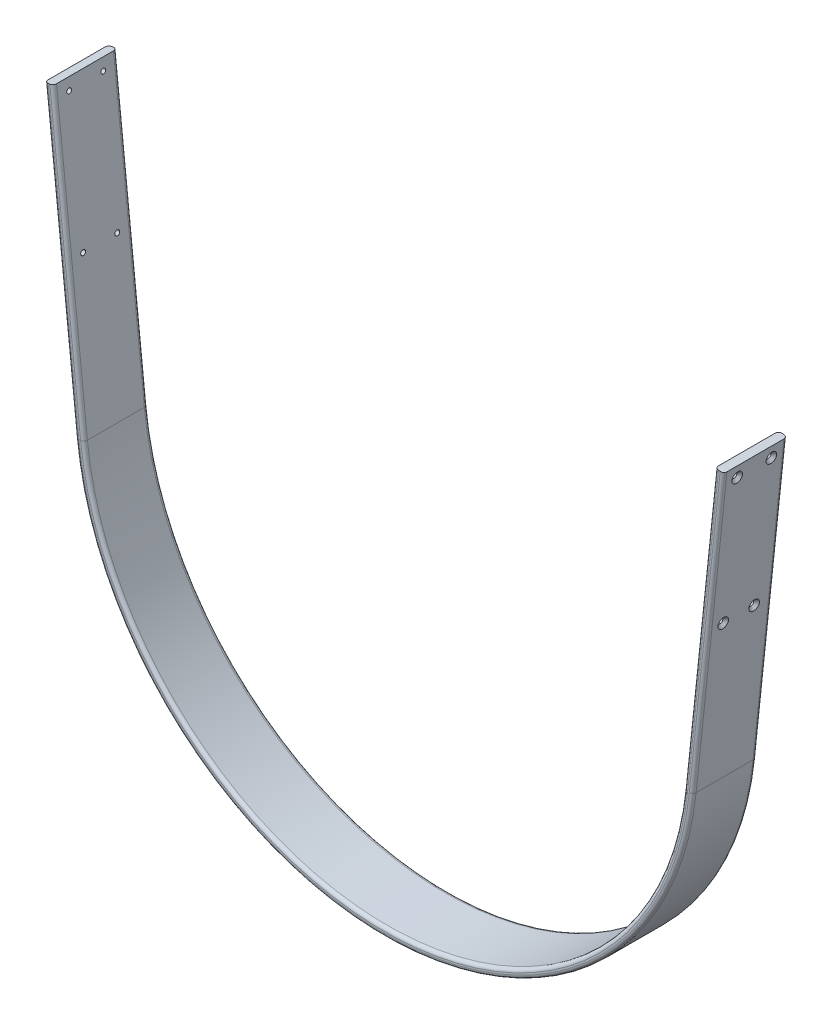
ISO-10303-21;
HEADER;
FILE_DESCRIPTION(('STEP AP214'),'2;1');
FILE_NAME('part.step','',(''),(''),'','','');
FILE_SCHEMA(('AUTOMOTIVE_DESIGN { 1 0 10303 214 1 1 1 1 }'));
ENDSEC;
DATA;
#1=APPLICATION_CONTEXT('core data for automotive mechanical design processes');
#2=APPLICATION_PROTOCOL_DEFINITION('international standard','automotive_design',2000,#1);
#3=PRODUCT_CONTEXT('',#1,'mechanical');
#4=PRODUCT('Part','Part','',(#3));
#5=PRODUCT_RELATED_PRODUCT_CATEGORY('part','',(#4));
#6=PRODUCT_DEFINITION_FORMATION('','',#4);
#7=PRODUCT_DEFINITION_CONTEXT('part definition',#1,'design');
#8=PRODUCT_DEFINITION('design','',#6,#7);
#9=PRODUCT_DEFINITION_SHAPE('','',#8);
#10=(LENGTH_UNIT() NAMED_UNIT(*) SI_UNIT(.MILLI.,.METRE.));
#11=(NAMED_UNIT(*) PLANE_ANGLE_UNIT() SI_UNIT($,.RADIAN.));
#12=(NAMED_UNIT(*) SI_UNIT($,.STERADIAN.) SOLID_ANGLE_UNIT());
#13=UNCERTAINTY_MEASURE_WITH_UNIT(LENGTH_MEASURE(1.E-05),#10,'distance_accuracy_value','');
#14=(GEOMETRIC_REPRESENTATION_CONTEXT(3) GLOBAL_UNCERTAINTY_ASSIGNED_CONTEXT((#13)) GLOBAL_UNIT_ASSIGNED_CONTEXT((#10,
#11,#12)) REPRESENTATION_CONTEXT('',''));
#15=CARTESIAN_POINT('',(0.,0.,0.));
#16=DIRECTION('',(0.,0.,1.));
#17=DIRECTION('',(1.,0.,0.));
#18=AXIS2_PLACEMENT_3D('',#15,#16,#17);
#19=CARTESIAN_POINT('',(0.,0.,56.));
#20=DIRECTION('',(0.,0.,-1.));
#21=DIRECTION('',(-1.,0.,0.));
#22=AXIS2_PLACEMENT_3D('',#19,#20,#21);
#23=CYLINDRICAL_SURFACE('',#22,545.);
#24=DIRECTION('',(0.,0.,-1.));
#25=VECTOR('',#24,1.);
#26=CARTESIAN_POINT('',(-542.014432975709,-56.9680124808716,56.));
#27=LINE('',#26,#25);
#28=CARTESIAN_POINT('',(-542.014432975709,-56.9680124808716,50.));
#29=VERTEX_POINT('',#28);
#30=CARTESIAN_POINT('',(-542.014432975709,-56.9680124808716,-50.));
#31=VERTEX_POINT('',#30);
#32=EDGE_CURVE('E207',#29,#31,#27,.T.);
#33=ORIENTED_EDGE('',*,*,#32,.T.);
#34=CARTESIAN_POINT('',(0.,0.,-50.));
#35=DIRECTION('',(0.,0.,1.));
#36=DIRECTION('',(1.,0.,0.));
#37=AXIS2_PLACEMENT_3D('',#34,#35,#36);
#38=CIRCLE('',#37,545.);
#39=CARTESIAN_POINT('',(542.014432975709,-56.9680124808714,-50.));
#40=VERTEX_POINT('',#39);
#41=EDGE_CURVE('E271',#31,#40,#38,.T.);
#42=ORIENTED_EDGE('',*,*,#41,.T.);
#43=DIRECTION('',(0.,0.,-1.));
#44=VECTOR('',#43,1.);
#45=CARTESIAN_POINT('',(542.014432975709,-56.9680124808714,56.));
#46=LINE('',#45,#44);
#47=CARTESIAN_POINT('',(542.014432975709,-56.9680124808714,50.));
#48=VERTEX_POINT('',#47);
#49=EDGE_CURVE('E176',#48,#40,#46,.T.);
#50=ORIENTED_EDGE('',*,*,#49,.F.);
#51=CARTESIAN_POINT('',(0.,0.,50.));
#52=DIRECTION('',(0.,0.,1.));
#53=DIRECTION('',(1.,0.,0.));
#54=AXIS2_PLACEMENT_3D('',#51,#52,#53);
#55=CIRCLE('',#54,545.);
#56=EDGE_CURVE('E51',#48,#29,#55,.F.);
#57=ORIENTED_EDGE('',*,*,#56,.T.);
#58=EDGE_LOOP('',(#33,#42,#50,#57));
#59=FACE_BOUND('',#58,.T.);
#60=ADVANCED_FACE('F30',(#59),#23,.T.);
#61=CARTESIAN_POINT('',(542.014432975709,-56.9680124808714,56.));
#62=DIRECTION('',(-0.994521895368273,0.104528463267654,0.));
#63=DIRECTION('',(-0.104528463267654,-0.994521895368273,0.));
#64=AXIS2_PLACEMENT_3D('',#61,#62,#63);
#65=PLANE('',#64);
#66=CARTESIAN_POINT('',(594.069607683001,438.303891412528,-30.));
#67=DIRECTION('',(-0.994521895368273,0.104528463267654,0.));
#68=DIRECTION('',(-0.104528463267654,-0.994521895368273,0.));
#69=AXIS2_PLACEMENT_3D('',#66,#67,#68);
#70=CIRCLE('',#69,9.24999999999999);
#71=CARTESIAN_POINT('',(593.102719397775,429.104563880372,-30.));
#72=VERTEX_POINT('',#71);
#73=EDGE_CURVE('E319',#72,#72,#70,.T.);
#74=ORIENTED_EDGE('',*,*,#73,.T.);
#75=EDGE_LOOP('',(#74));
#76=FACE_BOUND('',#75,.T.);
#77=CARTESIAN_POINT('',(594.069607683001,438.303891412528,30.));
#78=DIRECTION('',(-0.994521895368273,0.104528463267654,0.));
#79=DIRECTION('',(-0.104528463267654,-0.994521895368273,0.));
#80=AXIS2_PLACEMENT_3D('',#77,#78,#79);
#81=CIRCLE('',#80,9.24999999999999);
#82=CARTESIAN_POINT('',(593.102719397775,429.104563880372,30.));
#83=VERTEX_POINT('',#82);
#84=EDGE_CURVE('E316',#83,#83,#81,.T.);
#85=ORIENTED_EDGE('',*,*,#84,.T.);
#86=EDGE_LOOP('',(#85));
#87=FACE_BOUND('',#86,.T.);
#88=CARTESIAN_POINT('',(569.505418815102,204.591246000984,30.));
#89=DIRECTION('',(-0.994521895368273,0.104528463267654,0.));
#90=DIRECTION('',(-0.104528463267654,-0.994521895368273,0.));
#91=AXIS2_PLACEMENT_3D('',#88,#89,#90);
#92=CIRCLE('',#91,9.25);
#93=CARTESIAN_POINT('',(568.538530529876,195.391918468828,30.));
#94=VERTEX_POINT('',#93);
#95=EDGE_CURVE('E313',#94,#94,#92,.T.);
#96=ORIENTED_EDGE('',*,*,#95,.T.);
#97=EDGE_LOOP('',(#96));
#98=FACE_BOUND('',#97,.T.);
#99=CARTESIAN_POINT('',(569.505418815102,204.591246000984,-24.4242126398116));
#100=DIRECTION('',(-0.994521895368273,0.104528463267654,0.));
#101=DIRECTION('',(-0.104528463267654,-0.994521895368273,0.));
#102=AXIS2_PLACEMENT_3D('',#99,#100,#101);
#103=CIRCLE('',#102,9.25);
#104=CARTESIAN_POINT('',(568.538530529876,195.391918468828,-24.4242126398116));
#105=VERTEX_POINT('',#104);
#106=EDGE_CURVE('E310',#105,#105,#103,.T.);
#107=ORIENTED_EDGE('',*,*,#106,.T.);
#108=EDGE_LOOP('',(#107));
#109=FACE_BOUND('',#108,.T.);
#110=ORIENTED_EDGE('',*,*,#49,.T.);
#111=DIRECTION('',(0.104528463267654,0.994521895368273,0.));
#112=VECTOR('',#111,1.);
#113=CARTESIAN_POINT('',(542.014432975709,-56.9680124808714,-50.));
#114=LINE('',#113,#112);
#115=CARTESIAN_POINT('',(596.160176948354,458.194329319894,-50.));
#116=VERTEX_POINT('',#115);
#117=EDGE_CURVE('E267',#40,#116,#114,.T.);
#118=ORIENTED_EDGE('',*,*,#117,.T.);
#119=DIRECTION('',(0.,0.,-1.));
#120=VECTOR('',#119,1.);
#121=CARTESIAN_POINT('',(596.160176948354,458.194329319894,56.));
#122=LINE('',#121,#120);
#123=CARTESIAN_POINT('',(596.160176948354,458.194329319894,50.));
#124=VERTEX_POINT('',#123);
#125=EDGE_CURVE('E216',#124,#116,#122,.T.);
#126=ORIENTED_EDGE('',*,*,#125,.F.);
#127=DIRECTION('',(0.104528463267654,0.994521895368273,0.));
#128=VECTOR('',#127,1.);
#129=CARTESIAN_POINT('',(542.014432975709,-56.9680124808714,50.));
#130=LINE('',#129,#128);
#131=EDGE_CURVE('E265',#124,#48,#130,.F.);
#132=ORIENTED_EDGE('',*,*,#131,.T.);
#133=EDGE_LOOP('',(#110,#118,#126,#132));
#134=FACE_BOUND('',#133,.T.);
#135=ADVANCED_FACE('F347',(#76,#87,#98,#109,#134),#65,.F.);
#136=CARTESIAN_POINT('',(596.160176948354,458.194329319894,56.));
#137=DIRECTION('',(-0.104528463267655,-0.994521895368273,0.));
#138=DIRECTION('',(0.994521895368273,-0.104528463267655,0.));
#139=AXIS2_PLACEMENT_3D('',#136,#137,#138);
#140=PLANE('',#139);
#141=DIRECTION('',(-0.994521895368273,0.104528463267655,0.));
#142=VECTOR('',#141,1.);
#143=CARTESIAN_POINT('',(596.160176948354,458.194329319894,-56.));
#144=LINE('',#143,#142);
#145=CARTESIAN_POINT('',(590.193045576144,458.8215000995,-56.));
#146=VERTEX_POINT('',#145);
#147=CARTESIAN_POINT('',(587.209479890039,459.135085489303,-56.));
#148=VERTEX_POINT('',#147);
#149=EDGE_CURVE('E195',#146,#148,#144,.T.);
#150=ORIENTED_EDGE('',*,*,#149,.T.);
#151=CARTESIAN_POINT('',(587.209479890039,459.135085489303,-50.));
#152=DIRECTION('',(-0.104528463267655,-0.994521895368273,0.));
#153=DIRECTION('',(0.994521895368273,-0.104528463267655,0.));
#154=AXIS2_PLACEMENT_3D('',#151,#152,#153);
#155=CIRCLE('',#154,6.);
#156=CARTESIAN_POINT('',(581.24234851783,459.762256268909,-50.));
#157=VERTEX_POINT('',#156);
#158=EDGE_CURVE('E239',#148,#157,#155,.F.);
#159=ORIENTED_EDGE('',*,*,#158,.T.);
#160=DIRECTION('',(0.,0.,-1.));
#161=VECTOR('',#160,1.);
#162=CARTESIAN_POINT('',(581.24234851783,459.762256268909,56.));
#163=LINE('',#162,#161);
#164=CARTESIAN_POINT('',(581.24234851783,459.762256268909,50.));
#165=VERTEX_POINT('',#164);
#166=EDGE_CURVE('E167',#165,#157,#163,.T.);
#167=ORIENTED_EDGE('',*,*,#166,.F.);
#168=CARTESIAN_POINT('',(587.209479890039,459.135085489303,50.));
#169=DIRECTION('',(-0.104528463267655,-0.994521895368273,0.));
#170=DIRECTION('',(0.994521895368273,-0.104528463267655,0.));
#171=AXIS2_PLACEMENT_3D('',#168,#169,#170);
#172=CIRCLE('',#171,6.);
#173=CARTESIAN_POINT('',(587.209479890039,459.135085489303,56.));
#174=VERTEX_POINT('',#173);
#175=EDGE_CURVE('E175',#165,#174,#172,.F.);
#176=ORIENTED_EDGE('',*,*,#175,.T.);
#177=DIRECTION('',(-0.994521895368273,0.104528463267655,0.));
#178=VECTOR('',#177,1.);
#179=CARTESIAN_POINT('',(596.160176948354,458.194329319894,56.));
#180=LINE('',#179,#178);
#181=CARTESIAN_POINT('',(590.193045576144,458.8215000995,56.));
#182=VERTEX_POINT('',#181);
#183=EDGE_CURVE('E201',#182,#174,#180,.T.);
#184=ORIENTED_EDGE('',*,*,#183,.F.);
#185=CARTESIAN_POINT('',(590.193045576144,458.8215000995,50.));
#186=DIRECTION('',(-0.104528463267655,-0.994521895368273,0.));
#187=DIRECTION('',(0.994521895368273,-0.104528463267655,0.));
#188=AXIS2_PLACEMENT_3D('',#185,#186,#187);
#189=CIRCLE('',#188,6.);
#190=EDGE_CURVE('E234',#182,#124,#189,.F.);
#191=ORIENTED_EDGE('',*,*,#190,.T.);
#192=ORIENTED_EDGE('',*,*,#125,.T.);
#193=CARTESIAN_POINT('',(590.193045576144,458.8215000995,-50.));
#194=DIRECTION('',(-0.104528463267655,-0.994521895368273,0.));
#195=DIRECTION('',(0.994521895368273,-0.104528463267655,0.));
#196=AXIS2_PLACEMENT_3D('',#193,#194,#195);
#197=CIRCLE('',#196,6.);
#198=EDGE_CURVE('E236',#116,#146,#197,.F.);
#199=ORIENTED_EDGE('',*,*,#198,.T.);
#200=EDGE_LOOP('',(#150,#159,#167,#176,#184,#191,#192,#199));
#201=FACE_BOUND('',#200,.T.);
#202=ADVANCED_FACE('F351',(#201),#140,.F.);
#203=CARTESIAN_POINT('',(581.24234851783,459.762256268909,56.));
#204=DIRECTION('',(0.994521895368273,-0.104528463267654,0.));
#205=DIRECTION('',(0.104528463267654,0.994521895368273,0.));
#206=AXIS2_PLACEMENT_3D('',#203,#204,#205);
#207=PLANE('',#206);
#208=CARTESIAN_POINT('',(554.587590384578,206.159172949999,-24.4242126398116));
#209=DIRECTION('',(0.994521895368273,-0.104528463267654,0.));
#210=DIRECTION('',(0.104528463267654,0.994521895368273,0.));
#211=AXIS2_PLACEMENT_3D('',#208,#209,#210);
#212=CIRCLE('',#211,4.25);
#213=CARTESIAN_POINT('',(555.031836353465,210.385891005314,-24.4242126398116));
#214=VERTEX_POINT('',#213);
#215=EDGE_CURVE('E281',#214,#214,#212,.T.);
#216=ORIENTED_EDGE('',*,*,#215,.T.);
#217=EDGE_LOOP('',(#216));
#218=FACE_BOUND('',#217,.T.);
#219=CARTESIAN_POINT('',(554.587590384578,206.159172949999,30.));
#220=DIRECTION('',(0.994521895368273,-0.104528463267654,0.));
#221=DIRECTION('',(0.104528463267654,0.994521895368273,0.));
#222=AXIS2_PLACEMENT_3D('',#219,#220,#221);
#223=CIRCLE('',#222,4.24999999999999);
#224=CARTESIAN_POINT('',(555.031836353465,210.385891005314,30.));
#225=VERTEX_POINT('',#224);
#226=EDGE_CURVE('E277',#225,#225,#223,.T.);
#227=ORIENTED_EDGE('',*,*,#226,.T.);
#228=EDGE_LOOP('',(#227));
#229=FACE_BOUND('',#228,.T.);
#230=CARTESIAN_POINT('',(579.151779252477,439.871818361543,30.));
#231=DIRECTION('',(0.994521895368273,-0.104528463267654,0.));
#232=DIRECTION('',(0.104528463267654,0.994521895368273,0.));
#233=AXIS2_PLACEMENT_3D('',#230,#231,#232);
#234=CIRCLE('',#233,4.24999999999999);
#235=CARTESIAN_POINT('',(579.596025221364,444.098536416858,30.));
#236=VERTEX_POINT('',#235);
#237=EDGE_CURVE('E280',#236,#236,#234,.T.);
#238=ORIENTED_EDGE('',*,*,#237,.T.);
#239=EDGE_LOOP('',(#238));
#240=FACE_BOUND('',#239,.T.);
#241=CARTESIAN_POINT('',(579.151779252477,439.871818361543,-30.));
#242=DIRECTION('',(0.994521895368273,-0.104528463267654,0.));
#243=DIRECTION('',(0.104528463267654,0.994521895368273,0.));
#244=AXIS2_PLACEMENT_3D('',#241,#242,#243);
#245=CIRCLE('',#244,4.24999999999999);
#246=CARTESIAN_POINT('',(579.596025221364,444.098536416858,-30.));
#247=VERTEX_POINT('',#246);
#248=EDGE_CURVE('E405',#247,#247,#245,.T.);
#249=ORIENTED_EDGE('',*,*,#248,.T.);
#250=EDGE_LOOP('',(#249));
#251=FACE_BOUND('',#250,.T.);
#252=ORIENTED_EDGE('',*,*,#166,.T.);
#253=DIRECTION('',(-0.104528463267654,-0.994521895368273,0.));
#254=VECTOR('',#253,1.);
#255=CARTESIAN_POINT('',(581.24234851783,459.762256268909,-50.));
#256=LINE('',#255,#254);
#257=CARTESIAN_POINT('',(527.096604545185,-55.4000855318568,-50.));
#258=VERTEX_POINT('',#257);
#259=EDGE_CURVE('E166',#157,#258,#256,.T.);
#260=ORIENTED_EDGE('',*,*,#259,.T.);
#261=DIRECTION('',(0.,0.,-1.));
#262=VECTOR('',#261,1.);
#263=CARTESIAN_POINT('',(527.096604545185,-55.4000855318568,56.));
#264=LINE('',#263,#262);
#265=CARTESIAN_POINT('',(527.096604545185,-55.4000855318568,50.));
#266=VERTEX_POINT('',#265);
#267=EDGE_CURVE('E148',#266,#258,#264,.T.);
#268=ORIENTED_EDGE('',*,*,#267,.F.);
#269=DIRECTION('',(-0.104528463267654,-0.994521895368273,0.));
#270=VECTOR('',#269,1.);
#271=CARTESIAN_POINT('',(581.24234851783,459.762256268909,50.));
#272=LINE('',#271,#270);
#273=EDGE_CURVE('E163',#266,#165,#272,.F.);
#274=ORIENTED_EDGE('',*,*,#273,.T.);
#275=EDGE_LOOP('',(#252,#260,#268,#274));
#276=FACE_BOUND('',#275,.T.);
#277=ADVANCED_FACE('F162',(#218,#229,#240,#251,#276),#207,.F.);
#278=CARTESIAN_POINT('',(0.,0.,56.));
#279=DIRECTION('',(0.,0.,-1.));
#280=DIRECTION('',(-1.,0.,0.));
#281=AXIS2_PLACEMENT_3D('',#278,#279,#280);
#282=CYLINDRICAL_SURFACE('',#281,530.);
#283=ORIENTED_EDGE('',*,*,#267,.T.);
#284=CARTESIAN_POINT('',(0.,0.,-50.));
#285=DIRECTION('',(0.,0.,1.));
#286=DIRECTION('',(1.,0.,0.));
#287=AXIS2_PLACEMENT_3D('',#284,#285,#286);
#288=CIRCLE('',#287,530.);
#289=CARTESIAN_POINT('',(-527.096604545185,-55.4000855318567,-50.));
#290=VERTEX_POINT('',#289);
#291=EDGE_CURVE('E155',#258,#290,#288,.F.);
#292=ORIENTED_EDGE('',*,*,#291,.T.);
#293=DIRECTION('',(0.,0.,-1.));
#294=VECTOR('',#293,1.);
#295=CARTESIAN_POINT('',(-527.096604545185,-55.4000855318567,56.));
#296=LINE('',#295,#294);
#297=CARTESIAN_POINT('',(-527.096604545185,-55.4000855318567,50.));
#298=VERTEX_POINT('',#297);
#299=EDGE_CURVE('E150',#298,#290,#296,.T.);
#300=ORIENTED_EDGE('',*,*,#299,.F.);
#301=CARTESIAN_POINT('',(0.,0.,50.));
#302=DIRECTION('',(0.,0.,1.));
#303=DIRECTION('',(1.,0.,0.));
#304=AXIS2_PLACEMENT_3D('',#301,#302,#303);
#305=CIRCLE('',#304,530.);
#306=EDGE_CURVE('E145',#298,#266,#305,.T.);
#307=ORIENTED_EDGE('',*,*,#306,.T.);
#308=EDGE_LOOP('',(#283,#292,#300,#307));
#309=FACE_BOUND('',#308,.T.);
#310=ADVANCED_FACE('F147',(#309),#282,.F.);
#311=CARTESIAN_POINT('',(-581.24234851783,459.762256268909,56.));
#312=DIRECTION('',(-0.994521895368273,-0.104528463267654,0.));
#313=DIRECTION('',(0.104528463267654,-0.994521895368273,0.));
#314=AXIS2_PLACEMENT_3D('',#311,#312,#313);
#315=PLANE('',#314);
#316=CARTESIAN_POINT('',(-554.587590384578,206.159172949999,-30.));
#317=DIRECTION('',(-0.994521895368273,-0.104528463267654,0.));
#318=DIRECTION('',(0.104528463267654,-0.994521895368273,0.));
#319=AXIS2_PLACEMENT_3D('',#316,#317,#318);
#320=CIRCLE('',#319,4.25000000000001);
#321=CARTESIAN_POINT('',(-554.14334441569,201.932454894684,-30.));
#322=VERTEX_POINT('',#321);
#323=EDGE_CURVE('E402',#322,#322,#320,.T.);
#324=ORIENTED_EDGE('',*,*,#323,.T.);
#325=EDGE_LOOP('',(#324));
#326=FACE_BOUND('',#325,.T.);
#327=CARTESIAN_POINT('',(-554.587590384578,206.159172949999,29.9999999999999));
#328=DIRECTION('',(-0.994521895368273,-0.104528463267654,0.));
#329=DIRECTION('',(0.104528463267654,-0.994521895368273,0.));
#330=AXIS2_PLACEMENT_3D('',#327,#328,#329);
#331=CIRCLE('',#330,4.25000000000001);
#332=CARTESIAN_POINT('',(-554.14334441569,201.932454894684,29.9999999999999));
#333=VERTEX_POINT('',#332);
#334=EDGE_CURVE('E399',#333,#333,#331,.T.);
#335=ORIENTED_EDGE('',*,*,#334,.T.);
#336=EDGE_LOOP('',(#335));
#337=FACE_BOUND('',#336,.T.);
#338=CARTESIAN_POINT('',(-579.151779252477,439.871818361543,-30.0000000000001));
#339=DIRECTION('',(-0.994521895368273,-0.104528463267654,0.));
#340=DIRECTION('',(0.104528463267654,-0.994521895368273,0.));
#341=AXIS2_PLACEMENT_3D('',#338,#339,#340);
#342=CIRCLE('',#341,4.25);
#343=CARTESIAN_POINT('',(-578.707533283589,435.645100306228,-30.0000000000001));
#344=VERTEX_POINT('',#343);
#345=EDGE_CURVE('E394',#344,#344,#342,.T.);
#346=ORIENTED_EDGE('',*,*,#345,.T.);
#347=EDGE_LOOP('',(#346));
#348=FACE_BOUND('',#347,.T.);
#349=CARTESIAN_POINT('',(-579.151779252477,439.871818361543,29.9999999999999));
#350=DIRECTION('',(-0.994521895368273,-0.104528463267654,0.));
#351=DIRECTION('',(0.104528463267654,-0.994521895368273,0.));
#352=AXIS2_PLACEMENT_3D('',#349,#350,#351);
#353=CIRCLE('',#352,4.25);
#354=CARTESIAN_POINT('',(-578.707533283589,435.645100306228,29.9999999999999));
#355=VERTEX_POINT('',#354);
#356=EDGE_CURVE('E390',#355,#355,#353,.T.);
#357=ORIENTED_EDGE('',*,*,#356,.T.);
#358=EDGE_LOOP('',(#357));
#359=FACE_BOUND('',#358,.T.);
#360=ORIENTED_EDGE('',*,*,#299,.T.);
#361=DIRECTION('',(-0.104528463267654,0.994521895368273,0.));
#362=VECTOR('',#361,1.);
#363=CARTESIAN_POINT('',(-581.24234851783,459.762256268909,-50.));
#364=LINE('',#363,#362);
#365=CARTESIAN_POINT('',(-581.24234851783,459.762256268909,-50.));
#366=VERTEX_POINT('',#365);
#367=EDGE_CURVE('E255',#290,#366,#364,.T.);
#368=ORIENTED_EDGE('',*,*,#367,.T.);
#369=DIRECTION('',(0.,0.,-1.));
#370=VECTOR('',#369,1.);
#371=CARTESIAN_POINT('',(-581.24234851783,459.762256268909,56.));
#372=LINE('',#371,#370);
#373=CARTESIAN_POINT('',(-581.24234851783,459.762256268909,50.));
#374=VERTEX_POINT('',#373);
#375=EDGE_CURVE('E211',#374,#366,#372,.T.);
#376=ORIENTED_EDGE('',*,*,#375,.F.);
#377=DIRECTION('',(-0.104528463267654,0.994521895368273,0.));
#378=VECTOR('',#377,1.);
#379=CARTESIAN_POINT('',(-527.096604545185,-55.4000855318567,50.));
#380=LINE('',#379,#378);
#381=EDGE_CURVE('E253',#374,#298,#380,.F.);
#382=ORIENTED_EDGE('',*,*,#381,.T.);
#383=EDGE_LOOP('',(#360,#368,#376,#382));
#384=FACE_BOUND('',#383,.T.);
#385=ADVANCED_FACE('F491',(#326,#337,#348,#359,#384),#315,.F.);
#386=CARTESIAN_POINT('',(-596.160176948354,458.194329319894,56.));
#387=DIRECTION('',(0.104528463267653,-0.994521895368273,0.));
#388=DIRECTION('',(0.994521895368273,0.104528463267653,0.));
#389=AXIS2_PLACEMENT_3D('',#386,#387,#388);
#390=PLANE('',#389);
#391=ORIENTED_EDGE('',*,*,#375,.T.);
#392=CARTESIAN_POINT('',(-587.209479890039,459.135085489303,-50.));
#393=DIRECTION('',(0.104528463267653,-0.994521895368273,0.));
#394=DIRECTION('',(0.994521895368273,0.104528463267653,0.));
#395=AXIS2_PLACEMENT_3D('',#392,#393,#394);
#396=CIRCLE('',#395,6.);
#397=CARTESIAN_POINT('',(-587.209479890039,459.135085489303,-56.));
#398=VERTEX_POINT('',#397);
#399=EDGE_CURVE('E156',#366,#398,#396,.F.);
#400=ORIENTED_EDGE('',*,*,#399,.T.);
#401=DIRECTION('',(-0.994521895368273,-0.104528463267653,0.));
#402=VECTOR('',#401,1.);
#403=CARTESIAN_POINT('',(-596.160176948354,458.194329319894,-56.));
#404=LINE('',#403,#402);
#405=CARTESIAN_POINT('',(-590.193045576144,458.8215000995,-56.));
#406=VERTEX_POINT('',#405);
#407=EDGE_CURVE('E198',#398,#406,#404,.T.);
#408=ORIENTED_EDGE('',*,*,#407,.T.);
#409=CARTESIAN_POINT('',(-590.193045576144,458.8215000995,-50.));
#410=DIRECTION('',(0.104528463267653,-0.994521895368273,0.));
#411=DIRECTION('',(0.994521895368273,0.104528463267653,0.));
#412=AXIS2_PLACEMENT_3D('',#409,#410,#411);
#413=CIRCLE('',#412,6.);
#414=CARTESIAN_POINT('',(-596.160176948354,458.194329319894,-50.));
#415=VERTEX_POINT('',#414);
#416=EDGE_CURVE('E259',#406,#415,#413,.F.);
#417=ORIENTED_EDGE('',*,*,#416,.T.);
#418=DIRECTION('',(0.,0.,-1.));
#419=VECTOR('',#418,1.);
#420=CARTESIAN_POINT('',(-596.160176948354,458.194329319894,56.));
#421=LINE('',#420,#419);
#422=CARTESIAN_POINT('',(-596.160176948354,458.194329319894,50.));
#423=VERTEX_POINT('',#422);
#424=EDGE_CURVE('E209',#423,#415,#421,.T.);
#425=ORIENTED_EDGE('',*,*,#424,.F.);
#426=CARTESIAN_POINT('',(-590.193045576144,458.8215000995,50.));
#427=DIRECTION('',(0.104528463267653,-0.994521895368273,0.));
#428=DIRECTION('',(0.994521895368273,0.104528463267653,0.));
#429=AXIS2_PLACEMENT_3D('',#426,#427,#428);
#430=CIRCLE('',#429,6.);
#431=CARTESIAN_POINT('',(-590.193045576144,458.8215000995,56.));
#432=VERTEX_POINT('',#431);
#433=EDGE_CURVE('E257',#423,#432,#430,.F.);
#434=ORIENTED_EDGE('',*,*,#433,.T.);
#435=DIRECTION('',(-0.994521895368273,-0.104528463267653,0.));
#436=VECTOR('',#435,1.);
#437=CARTESIAN_POINT('',(-596.160176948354,458.194329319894,56.));
#438=LINE('',#437,#436);
#439=CARTESIAN_POINT('',(-587.209479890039,459.135085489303,56.));
#440=VERTEX_POINT('',#439);
#441=EDGE_CURVE('E204',#440,#432,#438,.T.);
#442=ORIENTED_EDGE('',*,*,#441,.F.);
#443=CARTESIAN_POINT('',(-587.209479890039,459.135085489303,50.));
#444=DIRECTION('',(0.104528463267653,-0.994521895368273,0.));
#445=DIRECTION('',(0.994521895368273,0.104528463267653,0.));
#446=AXIS2_PLACEMENT_3D('',#443,#444,#445);
#447=CIRCLE('',#446,6.);
#448=EDGE_CURVE('E261',#440,#374,#447,.F.);
#449=ORIENTED_EDGE('',*,*,#448,.T.);
#450=EDGE_LOOP('',(#391,#400,#408,#417,#425,#434,#442,#449));
#451=FACE_BOUND('',#450,.T.);
#452=ADVANCED_FACE('F487',(#451),#390,.F.);
#453=CARTESIAN_POINT('',(-542.014432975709,-56.9680124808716,56.));
#454=DIRECTION('',(0.994521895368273,0.104528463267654,0.));
#455=DIRECTION('',(-0.104528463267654,0.994521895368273,0.));
#456=AXIS2_PLACEMENT_3D('',#453,#454,#455);
#457=PLANE('',#456);
#458=CARTESIAN_POINT('',(-594.069607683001,438.303891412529,29.9999999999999));
#459=DIRECTION('',(0.994521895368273,0.104528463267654,0.));
#460=DIRECTION('',(-0.104528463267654,0.994521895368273,0.));
#461=AXIS2_PLACEMENT_3D('',#458,#459,#460);
#462=CIRCLE('',#461,9.24999999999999);
#463=CARTESIAN_POINT('',(-595.036495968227,447.503218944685,29.9999999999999));
#464=VERTEX_POINT('',#463);
#465=EDGE_CURVE('E295',#464,#464,#462,.T.);
#466=ORIENTED_EDGE('',*,*,#465,.T.);
#467=EDGE_LOOP('',(#466));
#468=FACE_BOUND('',#467,.T.);
#469=CARTESIAN_POINT('',(-594.069607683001,438.303891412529,-30.0000000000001));
#470=DIRECTION('',(0.994521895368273,0.104528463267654,0.));
#471=DIRECTION('',(-0.104528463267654,0.994521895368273,0.));
#472=AXIS2_PLACEMENT_3D('',#469,#470,#471);
#473=CIRCLE('',#472,9.24999999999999);
#474=CARTESIAN_POINT('',(-595.036495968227,447.503218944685,-30.0000000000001));
#475=VERTEX_POINT('',#474);
#476=EDGE_CURVE('E292',#475,#475,#473,.T.);
#477=ORIENTED_EDGE('',*,*,#476,.T.);
#478=EDGE_LOOP('',(#477));
#479=FACE_BOUND('',#478,.T.);
#480=CARTESIAN_POINT('',(-569.505418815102,204.591246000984,29.9999999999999));
#481=DIRECTION('',(0.994521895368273,0.104528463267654,0.));
#482=DIRECTION('',(-0.104528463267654,0.994521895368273,0.));
#483=AXIS2_PLACEMENT_3D('',#480,#481,#482);
#484=CIRCLE('',#483,9.24999999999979);
#485=CARTESIAN_POINT('',(-570.472307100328,213.790573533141,29.9999999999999));
#486=VERTEX_POINT('',#485);
#487=EDGE_CURVE('E289',#486,#486,#484,.T.);
#488=ORIENTED_EDGE('',*,*,#487,.T.);
#489=EDGE_LOOP('',(#488));
#490=FACE_BOUND('',#489,.T.);
#491=CARTESIAN_POINT('',(-569.505418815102,204.591246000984,-30.));
#492=DIRECTION('',(0.994521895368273,0.104528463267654,0.));
#493=DIRECTION('',(-0.104528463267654,0.994521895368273,0.));
#494=AXIS2_PLACEMENT_3D('',#491,#492,#493);
#495=CIRCLE('',#494,9.24999999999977);
#496=CARTESIAN_POINT('',(-570.472307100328,213.790573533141,-30.));
#497=VERTEX_POINT('',#496);
#498=EDGE_CURVE('E286',#497,#497,#495,.T.);
#499=ORIENTED_EDGE('',*,*,#498,.T.);
#500=EDGE_LOOP('',(#499));
#501=FACE_BOUND('',#500,.T.);
#502=ORIENTED_EDGE('',*,*,#424,.T.);
#503=DIRECTION('',(0.104528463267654,-0.994521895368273,0.));
#504=VECTOR('',#503,1.);
#505=CARTESIAN_POINT('',(-542.014432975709,-56.9680124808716,-50.));
#506=LINE('',#505,#504);
#507=EDGE_CURVE('E44',#415,#31,#506,.T.);
#508=ORIENTED_EDGE('',*,*,#507,.T.);
#509=ORIENTED_EDGE('',*,*,#32,.F.);
#510=DIRECTION('',(0.104528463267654,-0.994521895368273,0.));
#511=VECTOR('',#510,1.);
#512=CARTESIAN_POINT('',(-596.160176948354,458.194329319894,50.));
#513=LINE('',#512,#511);
#514=EDGE_CURVE('E273',#29,#423,#513,.F.);
#515=ORIENTED_EDGE('',*,*,#514,.T.);
#516=EDGE_LOOP('',(#502,#508,#509,#515));
#517=FACE_BOUND('',#516,.T.);
#518=ADVANCED_FACE('F484',(#468,#479,#490,#501,#517),#457,.F.);
#519=CARTESIAN_POINT('',(0.,0.,56.));
#520=DIRECTION('',(0.,0.,1.));
#521=DIRECTION('',(1.,0.,0.));
#522=AXIS2_PLACEMENT_3D('',#519,#520,#521);
#523=PLANE('',#522);
#524=ORIENTED_EDGE('',*,*,#183,.T.);
#525=DIRECTION('',(-0.104528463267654,-0.994521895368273,0.));
#526=VECTOR('',#525,1.);
#527=CARTESIAN_POINT('',(533.063735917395,-56.0272563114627,56.));
#528=LINE('',#527,#526);
#529=CARTESIAN_POINT('',(533.063735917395,-56.0272563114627,56.));
#530=VERTEX_POINT('',#529);
#531=EDGE_CURVE('E251',#174,#530,#528,.T.);
#532=ORIENTED_EDGE('',*,*,#531,.T.);
#533=CARTESIAN_POINT('',(0.,0.,56.));
#534=DIRECTION('',(0.,0.,1.));
#535=DIRECTION('',(1.,0.,0.));
#536=AXIS2_PLACEMENT_3D('',#533,#534,#535);
#537=CIRCLE('',#536,536.);
#538=CARTESIAN_POINT('',(-533.063735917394,-56.0272563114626,56.));
#539=VERTEX_POINT('',#538);
#540=EDGE_CURVE('E179',#530,#539,#537,.F.);
#541=ORIENTED_EDGE('',*,*,#540,.T.);
#542=DIRECTION('',(-0.104528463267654,0.994521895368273,0.));
#543=VECTOR('',#542,1.);
#544=CARTESIAN_POINT('',(-587.209479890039,459.135085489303,56.));
#545=LINE('',#544,#543);
#546=EDGE_CURVE('E248',#539,#440,#545,.T.);
#547=ORIENTED_EDGE('',*,*,#546,.T.);
#548=ORIENTED_EDGE('',*,*,#441,.T.);
#549=DIRECTION('',(0.104528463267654,-0.994521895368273,0.));
#550=VECTOR('',#549,1.);
#551=CARTESIAN_POINT('',(-536.047301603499,-56.3408417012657,56.));
#552=LINE('',#551,#550);
#553=CARTESIAN_POINT('',(-536.047301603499,-56.3408417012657,56.));
#554=VERTEX_POINT('',#553);
#555=EDGE_CURVE('E241',#432,#554,#552,.T.);
#556=ORIENTED_EDGE('',*,*,#555,.T.);
#557=CARTESIAN_POINT('',(0.,0.,56.));
#558=DIRECTION('',(0.,0.,1.));
#559=DIRECTION('',(1.,0.,0.));
#560=AXIS2_PLACEMENT_3D('',#557,#558,#559);
#561=CIRCLE('',#560,539.);
#562=CARTESIAN_POINT('',(536.047301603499,-56.3408417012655,56.));
#563=VERTEX_POINT('',#562);
#564=EDGE_CURVE('E243',#554,#563,#561,.T.);
#565=ORIENTED_EDGE('',*,*,#564,.T.);
#566=DIRECTION('',(0.104528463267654,0.994521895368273,0.));
#567=VECTOR('',#566,1.);
#568=CARTESIAN_POINT('',(590.193045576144,458.8215000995,56.));
#569=LINE('',#568,#567);
#570=EDGE_CURVE('E245',#563,#182,#569,.T.);
#571=ORIENTED_EDGE('',*,*,#570,.T.);
#572=EDGE_LOOP('',(#524,#532,#541,#547,#548,#556,#565,#571));
#573=FACE_BOUND('',#572,.T.);
#574=ADVANCED_FACE('F381',(#573),#523,.T.);
#575=CARTESIAN_POINT('',(0.,0.,-56.));
#576=DIRECTION('',(0.,0.,1.));
#577=DIRECTION('',(1.,0.,0.));
#578=AXIS2_PLACEMENT_3D('',#575,#576,#577);
#579=PLANE('',#578);
#580=CARTESIAN_POINT('',(0.,0.,-56.));
#581=DIRECTION('',(0.,0.,1.));
#582=DIRECTION('',(1.,0.,0.));
#583=AXIS2_PLACEMENT_3D('',#580,#581,#582);
#584=CIRCLE('',#583,536.);
#585=CARTESIAN_POINT('',(-533.063735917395,-56.0272563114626,-56.));
#586=VERTEX_POINT('',#585);
#587=CARTESIAN_POINT('',(533.063735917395,-56.0272563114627,-56.));
#588=VERTEX_POINT('',#587);
#589=EDGE_CURVE('E228',#586,#588,#584,.T.);
#590=ORIENTED_EDGE('',*,*,#589,.T.);
#591=DIRECTION('',(-0.104528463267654,-0.994521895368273,0.));
#592=VECTOR('',#591,1.);
#593=CARTESIAN_POINT('',(533.063735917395,-56.0272563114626,-56.));
#594=LINE('',#593,#592);
#595=EDGE_CURVE('E232',#588,#148,#594,.F.);
#596=ORIENTED_EDGE('',*,*,#595,.T.);
#597=ORIENTED_EDGE('',*,*,#149,.F.);
#598=DIRECTION('',(0.104528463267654,0.994521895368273,0.));
#599=VECTOR('',#598,1.);
#600=CARTESIAN_POINT('',(536.047301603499,-56.3408417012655,-56.));
#601=LINE('',#600,#599);
#602=CARTESIAN_POINT('',(536.047301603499,-56.3408417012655,-56.));
#603=VERTEX_POINT('',#602);
#604=EDGE_CURVE('E226',#146,#603,#601,.F.);
#605=ORIENTED_EDGE('',*,*,#604,.T.);
#606=CARTESIAN_POINT('',(0.,0.,-56.));
#607=DIRECTION('',(0.,0.,1.));
#608=DIRECTION('',(1.,0.,0.));
#609=AXIS2_PLACEMENT_3D('',#606,#607,#608);
#610=CIRCLE('',#609,539.);
#611=CARTESIAN_POINT('',(-536.047301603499,-56.3408417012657,-56.));
#612=VERTEX_POINT('',#611);
#613=EDGE_CURVE('E224',#603,#612,#610,.F.);
#614=ORIENTED_EDGE('',*,*,#613,.T.);
#615=DIRECTION('',(0.104528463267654,-0.994521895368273,0.));
#616=VECTOR('',#615,1.);
#617=CARTESIAN_POINT('',(-536.047301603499,-56.3408417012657,-56.));
#618=LINE('',#617,#616);
#619=EDGE_CURVE('E222',#612,#406,#618,.F.);
#620=ORIENTED_EDGE('',*,*,#619,.T.);
#621=ORIENTED_EDGE('',*,*,#407,.F.);
#622=DIRECTION('',(-0.104528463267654,0.994521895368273,0.));
#623=VECTOR('',#622,1.);
#624=CARTESIAN_POINT('',(-533.063735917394,-56.0272563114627,-56.));
#625=LINE('',#624,#623);
#626=EDGE_CURVE('E230',#398,#586,#625,.F.);
#627=ORIENTED_EDGE('',*,*,#626,.T.);
#628=EDGE_LOOP('',(#590,#596,#597,#605,#614,#620,#621,#627));
#629=FACE_BOUND('',#628,.T.);
#630=ADVANCED_FACE('F477',(#629),#579,.F.);
#631=CARTESIAN_POINT('',(-587.209479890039,459.135085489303,-50.));
#632=DIRECTION('',(-0.104528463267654,0.994521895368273,0.));
#633=DIRECTION('',(-0.994521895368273,-0.104528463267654,0.));
#634=AXIS2_PLACEMENT_3D('',#631,#632,#633);
#635=CYLINDRICAL_SURFACE('',#634,6.);
#636=ORIENTED_EDGE('',*,*,#399,.F.);
#637=ORIENTED_EDGE('',*,*,#367,.F.);
#638=CARTESIAN_POINT('',(-533.063735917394,-56.0272563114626,-50.));
#639=DIRECTION('',(0.104528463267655,-0.994521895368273,0.));
#640=DIRECTION('',(0.994521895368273,0.104528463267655,0.));
#641=AXIS2_PLACEMENT_3D('',#638,#639,#640);
#642=CIRCLE('',#641,6.);
#643=EDGE_CURVE('E192',#586,#290,#642,.T.);
#644=ORIENTED_EDGE('',*,*,#643,.F.);
#645=ORIENTED_EDGE('',*,*,#626,.F.);
#646=EDGE_LOOP('',(#636,#637,#644,#645));
#647=FACE_BOUND('',#646,.T.);
#648=ADVANCED_FACE('F473',(#647),#635,.T.);
#649=CARTESIAN_POINT('',(0.,0.,-50.));
#650=DIRECTION('',(0.,0.,1.));
#651=DIRECTION('',(1.,0.,0.));
#652=AXIS2_PLACEMENT_3D('',#649,#650,#651);
#653=TOROIDAL_SURFACE('',#652,536.,6.);
#654=ORIENTED_EDGE('',*,*,#643,.T.);
#655=ORIENTED_EDGE('',*,*,#291,.F.);
#656=CARTESIAN_POINT('',(533.063735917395,-56.0272563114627,-50.));
#657=DIRECTION('',(0.104528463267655,0.994521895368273,0.));
#658=DIRECTION('',(-0.994521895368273,0.104528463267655,0.));
#659=AXIS2_PLACEMENT_3D('',#656,#657,#658);
#660=CIRCLE('',#659,6.);
#661=EDGE_CURVE('E184',#588,#258,#660,.T.);
#662=ORIENTED_EDGE('',*,*,#661,.F.);
#663=ORIENTED_EDGE('',*,*,#589,.F.);
#664=EDGE_LOOP('',(#654,#655,#662,#663));
#665=FACE_BOUND('',#664,.T.);
#666=ADVANCED_FACE('F469',(#665),#653,.T.);
#667=CARTESIAN_POINT('',(587.209479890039,459.135085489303,-50.));
#668=DIRECTION('',(-0.104528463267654,-0.994521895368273,0.));
#669=DIRECTION('',(0.994521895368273,-0.104528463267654,0.));
#670=AXIS2_PLACEMENT_3D('',#667,#668,#669);
#671=CYLINDRICAL_SURFACE('',#670,6.);
#672=ORIENTED_EDGE('',*,*,#158,.F.);
#673=ORIENTED_EDGE('',*,*,#595,.F.);
#674=ORIENTED_EDGE('',*,*,#661,.T.);
#675=ORIENTED_EDGE('',*,*,#259,.F.);
#676=EDGE_LOOP('',(#672,#673,#674,#675));
#677=FACE_BOUND('',#676,.T.);
#678=ADVANCED_FACE('F465',(#677),#671,.T.);
#679=CARTESIAN_POINT('',(-533.063735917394,-56.0272563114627,50.));
#680=DIRECTION('',(0.104528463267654,-0.994521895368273,0.));
#681=DIRECTION('',(0.994521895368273,0.104528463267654,0.));
#682=AXIS2_PLACEMENT_3D('',#679,#680,#681);
#683=CYLINDRICAL_SURFACE('',#682,6.);
#684=ORIENTED_EDGE('',*,*,#448,.F.);
#685=ORIENTED_EDGE('',*,*,#546,.F.);
#686=CARTESIAN_POINT('',(-533.063735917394,-56.0272563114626,50.));
#687=DIRECTION('',(0.104528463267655,-0.994521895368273,0.));
#688=DIRECTION('',(0.994521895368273,0.104528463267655,0.));
#689=AXIS2_PLACEMENT_3D('',#686,#687,#688);
#690=CIRCLE('',#689,6.);
#691=EDGE_CURVE('E181',#298,#539,#690,.T.);
#692=ORIENTED_EDGE('',*,*,#691,.F.);
#693=ORIENTED_EDGE('',*,*,#381,.F.);
#694=EDGE_LOOP('',(#684,#685,#692,#693));
#695=FACE_BOUND('',#694,.T.);
#696=ADVANCED_FACE('F462',(#695),#683,.T.);
#697=CARTESIAN_POINT('',(0.,0.,50.));
#698=DIRECTION('',(0.,0.,1.));
#699=DIRECTION('',(1.,0.,0.));
#700=AXIS2_PLACEMENT_3D('',#697,#698,#699);
#701=TOROIDAL_SURFACE('',#700,536.,6.);
#702=ORIENTED_EDGE('',*,*,#691,.T.);
#703=ORIENTED_EDGE('',*,*,#540,.F.);
#704=CARTESIAN_POINT('',(533.063735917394,-56.0272563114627,50.));
#705=DIRECTION('',(0.104528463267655,0.994521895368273,0.));
#706=DIRECTION('',(-0.994521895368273,0.104528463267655,0.));
#707=AXIS2_PLACEMENT_3D('',#704,#705,#706);
#708=CIRCLE('',#707,6.);
#709=EDGE_CURVE('E173',#266,#530,#708,.T.);
#710=ORIENTED_EDGE('',*,*,#709,.F.);
#711=ORIENTED_EDGE('',*,*,#306,.F.);
#712=EDGE_LOOP('',(#702,#703,#710,#711));
#713=FACE_BOUND('',#712,.T.);
#714=ADVANCED_FACE('F178',(#713),#701,.T.);
#715=CARTESIAN_POINT('',(533.063735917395,-56.0272563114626,50.));
#716=DIRECTION('',(0.104528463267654,0.994521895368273,0.));
#717=DIRECTION('',(-0.994521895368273,0.104528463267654,0.));
#718=AXIS2_PLACEMENT_3D('',#715,#716,#717);
#719=CYLINDRICAL_SURFACE('',#718,6.);
#720=ORIENTED_EDGE('',*,*,#175,.F.);
#721=ORIENTED_EDGE('',*,*,#273,.F.);
#722=ORIENTED_EDGE('',*,*,#709,.T.);
#723=ORIENTED_EDGE('',*,*,#531,.F.);
#724=EDGE_LOOP('',(#720,#721,#722,#723));
#725=FACE_BOUND('',#724,.T.);
#726=ADVANCED_FACE('F171',(#725),#719,.T.);
#727=CARTESIAN_POINT('',(-536.047301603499,-56.3408417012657,-50.));
#728=DIRECTION('',(0.104528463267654,-0.994521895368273,0.));
#729=DIRECTION('',(0.994521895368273,0.104528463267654,0.));
#730=AXIS2_PLACEMENT_3D('',#727,#728,#729);
#731=CYLINDRICAL_SURFACE('',#730,6.);
#732=ORIENTED_EDGE('',*,*,#416,.F.);
#733=ORIENTED_EDGE('',*,*,#619,.F.);
#734=CARTESIAN_POINT('',(-536.047301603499,-56.3408417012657,-50.));
#735=DIRECTION('',(0.104528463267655,-0.994521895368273,0.));
#736=DIRECTION('',(0.994521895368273,0.104528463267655,0.));
#737=AXIS2_PLACEMENT_3D('',#734,#735,#736);
#738=CIRCLE('',#737,6.);
#739=EDGE_CURVE('E182',#31,#612,#738,.T.);
#740=ORIENTED_EDGE('',*,*,#739,.F.);
#741=ORIENTED_EDGE('',*,*,#507,.F.);
#742=EDGE_LOOP('',(#732,#733,#740,#741));
#743=FACE_BOUND('',#742,.T.);
#744=ADVANCED_FACE('F359',(#743),#731,.T.);
#745=CARTESIAN_POINT('',(0.,0.,-50.));
#746=DIRECTION('',(0.,0.,1.));
#747=DIRECTION('',(1.,0.,0.));
#748=AXIS2_PLACEMENT_3D('',#745,#746,#747);
#749=TOROIDAL_SURFACE('',#748,539.,6.);
#750=ORIENTED_EDGE('',*,*,#739,.T.);
#751=ORIENTED_EDGE('',*,*,#613,.F.);
#752=CARTESIAN_POINT('',(536.047301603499,-56.3408417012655,-50.));
#753=DIRECTION('',(0.104528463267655,0.994521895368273,0.));
#754=DIRECTION('',(-0.994521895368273,0.104528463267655,0.));
#755=AXIS2_PLACEMENT_3D('',#752,#753,#754);
#756=CIRCLE('',#755,6.);
#757=EDGE_CURVE('E187',#40,#603,#756,.T.);
#758=ORIENTED_EDGE('',*,*,#757,.F.);
#759=ORIENTED_EDGE('',*,*,#41,.F.);
#760=EDGE_LOOP('',(#750,#751,#758,#759));
#761=FACE_BOUND('',#760,.T.);
#762=ADVANCED_FACE('F363',(#761),#749,.T.);
#763=CARTESIAN_POINT('',(536.047301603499,-56.3408417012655,-50.));
#764=DIRECTION('',(0.104528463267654,0.994521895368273,0.));
#765=DIRECTION('',(-0.994521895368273,0.104528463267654,0.));
#766=AXIS2_PLACEMENT_3D('',#763,#764,#765);
#767=CYLINDRICAL_SURFACE('',#766,6.);
#768=ORIENTED_EDGE('',*,*,#757,.T.);
#769=ORIENTED_EDGE('',*,*,#604,.F.);
#770=ORIENTED_EDGE('',*,*,#198,.F.);
#771=ORIENTED_EDGE('',*,*,#117,.F.);
#772=EDGE_LOOP('',(#768,#769,#770,#771));
#773=FACE_BOUND('',#772,.T.);
#774=ADVANCED_FACE('F369',(#773),#767,.T.);
#775=CARTESIAN_POINT('',(-536.047301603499,-56.3408417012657,50.));
#776=DIRECTION('',(-0.104528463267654,0.994521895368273,0.));
#777=DIRECTION('',(-0.994521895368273,-0.104528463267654,0.));
#778=AXIS2_PLACEMENT_3D('',#775,#776,#777);
#779=CYLINDRICAL_SURFACE('',#778,6.);
#780=ORIENTED_EDGE('',*,*,#433,.F.);
#781=ORIENTED_EDGE('',*,*,#514,.F.);
#782=CARTESIAN_POINT('',(-536.047301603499,-56.3408417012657,50.));
#783=DIRECTION('',(0.104528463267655,-0.994521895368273,0.));
#784=DIRECTION('',(0.994521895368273,0.104528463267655,0.));
#785=AXIS2_PLACEMENT_3D('',#782,#783,#784);
#786=CIRCLE('',#785,6.);
#787=EDGE_CURVE('E368',#554,#29,#786,.T.);
#788=ORIENTED_EDGE('',*,*,#787,.F.);
#789=ORIENTED_EDGE('',*,*,#555,.F.);
#790=EDGE_LOOP('',(#780,#781,#788,#789));
#791=FACE_BOUND('',#790,.T.);
#792=ADVANCED_FACE('F448',(#791),#779,.T.);
#793=CARTESIAN_POINT('',(0.,0.,50.));
#794=DIRECTION('',(0.,0.,1.));
#795=DIRECTION('',(1.,0.,0.));
#796=AXIS2_PLACEMENT_3D('',#793,#794,#795);
#797=TOROIDAL_SURFACE('',#796,539.,6.);
#798=ORIENTED_EDGE('',*,*,#787,.T.);
#799=ORIENTED_EDGE('',*,*,#56,.F.);
#800=CARTESIAN_POINT('',(536.047301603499,-56.3408417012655,50.));
#801=DIRECTION('',(0.104528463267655,0.994521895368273,0.));
#802=DIRECTION('',(-0.994521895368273,0.104528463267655,0.));
#803=AXIS2_PLACEMENT_3D('',#800,#801,#802);
#804=CIRCLE('',#803,6.);
#805=EDGE_CURVE('E388',#563,#48,#804,.T.);
#806=ORIENTED_EDGE('',*,*,#805,.F.);
#807=ORIENTED_EDGE('',*,*,#564,.F.);
#808=EDGE_LOOP('',(#798,#799,#806,#807));
#809=FACE_BOUND('',#808,.T.);
#810=ADVANCED_FACE('F389',(#809),#797,.T.);
#811=CARTESIAN_POINT('',(536.047301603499,-56.3408417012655,50.));
#812=DIRECTION('',(-0.104528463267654,-0.994521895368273,0.));
#813=DIRECTION('',(0.994521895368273,-0.104528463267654,0.));
#814=AXIS2_PLACEMENT_3D('',#811,#812,#813);
#815=CYLINDRICAL_SURFACE('',#814,6.);
#816=ORIENTED_EDGE('',*,*,#805,.T.);
#817=ORIENTED_EDGE('',*,*,#131,.F.);
#818=ORIENTED_EDGE('',*,*,#190,.F.);
#819=ORIENTED_EDGE('',*,*,#570,.F.);
#820=EDGE_LOOP('',(#816,#817,#818,#819));
#821=FACE_BOUND('',#820,.T.);
#822=ADVANCED_FACE('F379',(#821),#815,.T.);
#823=CARTESIAN_POINT('',(-574.179169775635,440.394460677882,29.9999999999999));
#824=DIRECTION('',(-0.994521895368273,-0.104528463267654,0.));
#825=DIRECTION('',(0.104528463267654,-0.994521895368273,0.));
#826=AXIS2_PLACEMENT_3D('',#823,#824,#825);
#827=CYLINDRICAL_SURFACE('',#826,4.25);
#828=CARTESIAN_POINT('',(-589.096998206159,438.826533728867,29.9999999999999));
#829=DIRECTION('',(0.994521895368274,0.104528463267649,0.));
#830=DIRECTION('',(-0.104528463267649,0.994521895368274,0.));
#831=AXIS2_PLACEMENT_3D('',#828,#829,#830);
#832=CIRCLE('',#831,4.25);
#833=CARTESIAN_POINT('',(-589.541244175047,443.053251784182,29.9999999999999));
#834=VERTEX_POINT('',#833);
#835=EDGE_CURVE('E276',#834,#834,#832,.F.);
#836=ORIENTED_EDGE('',*,*,#835,.T.);
#837=EDGE_LOOP('',(#836));
#838=FACE_BOUND('',#837,.T.);
#839=ORIENTED_EDGE('',*,*,#356,.F.);
#840=EDGE_LOOP('',(#839));
#841=FACE_BOUND('',#840,.T.);
#842=ADVANCED_FACE('F439',(#838,#841),#827,.F.);
#843=CARTESIAN_POINT('',(-574.179169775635,440.394460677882,-30.0000000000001));
#844=DIRECTION('',(-0.994521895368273,-0.104528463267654,0.));
#845=DIRECTION('',(0.104528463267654,-0.994521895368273,0.));
#846=AXIS2_PLACEMENT_3D('',#843,#844,#845);
#847=CYLINDRICAL_SURFACE('',#846,4.25);
#848=CARTESIAN_POINT('',(-589.096998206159,438.826533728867,-30.0000000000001));
#849=DIRECTION('',(0.994521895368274,0.104528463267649,0.));
#850=DIRECTION('',(-0.104528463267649,0.994521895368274,0.));
#851=AXIS2_PLACEMENT_3D('',#848,#849,#850);
#852=CIRCLE('',#851,4.25);
#853=CARTESIAN_POINT('',(-589.541244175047,443.053251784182,-30.0000000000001));
#854=VERTEX_POINT('',#853);
#855=EDGE_CURVE('E298',#854,#854,#852,.F.);
#856=ORIENTED_EDGE('',*,*,#855,.T.);
#857=EDGE_LOOP('',(#856));
#858=FACE_BOUND('',#857,.T.);
#859=ORIENTED_EDGE('',*,*,#345,.F.);
#860=EDGE_LOOP('',(#859));
#861=FACE_BOUND('',#860,.T.);
#862=ADVANCED_FACE('F435',(#858,#861),#847,.F.);
#863=CARTESIAN_POINT('',(-549.614980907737,206.681815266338,29.9999999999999));
#864=DIRECTION('',(-0.994521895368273,-0.104528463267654,0.));
#865=DIRECTION('',(0.104528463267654,-0.994521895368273,0.));
#866=AXIS2_PLACEMENT_3D('',#863,#864,#865);
#867=CYLINDRICAL_SURFACE('',#866,4.25000000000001);
#868=CARTESIAN_POINT('',(-564.532809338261,205.113888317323,29.9999999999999));
#869=DIRECTION('',(0.994521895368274,0.104528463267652,0.));
#870=DIRECTION('',(-0.104528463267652,0.994521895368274,0.));
#871=AXIS2_PLACEMENT_3D('',#868,#869,#870);
#872=CIRCLE('',#871,4.25000000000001);
#873=CARTESIAN_POINT('',(-564.977055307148,209.340606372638,29.9999999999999));
#874=VERTEX_POINT('',#873);
#875=EDGE_CURVE('E301',#874,#874,#872,.F.);
#876=ORIENTED_EDGE('',*,*,#875,.T.);
#877=EDGE_LOOP('',(#876));
#878=FACE_BOUND('',#877,.T.);
#879=ORIENTED_EDGE('',*,*,#334,.F.);
#880=EDGE_LOOP('',(#879));
#881=FACE_BOUND('',#880,.T.);
#882=ADVANCED_FACE('F431',(#878,#881),#867,.F.);
#883=CARTESIAN_POINT('',(-549.614980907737,206.681815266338,-30.));
#884=DIRECTION('',(-0.994521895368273,-0.104528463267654,0.));
#885=DIRECTION('',(0.104528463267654,-0.994521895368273,0.));
#886=AXIS2_PLACEMENT_3D('',#883,#884,#885);
#887=CYLINDRICAL_SURFACE('',#886,4.25000000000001);
#888=CARTESIAN_POINT('',(-564.532809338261,205.113888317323,-30.));
#889=DIRECTION('',(0.994521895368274,0.104528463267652,0.));
#890=DIRECTION('',(-0.104528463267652,0.994521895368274,0.));
#891=AXIS2_PLACEMENT_3D('',#888,#889,#890);
#892=CIRCLE('',#891,4.25000000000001);
#893=CARTESIAN_POINT('',(-564.977055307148,209.340606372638,-30.));
#894=VERTEX_POINT('',#893);
#895=EDGE_CURVE('E304',#894,#894,#892,.F.);
#896=ORIENTED_EDGE('',*,*,#895,.T.);
#897=EDGE_LOOP('',(#896));
#898=FACE_BOUND('',#897,.T.);
#899=ORIENTED_EDGE('',*,*,#323,.F.);
#900=EDGE_LOOP('',(#899));
#901=FACE_BOUND('',#900,.T.);
#902=ADVANCED_FACE('F424',(#898,#901),#887,.F.);
#903=CARTESIAN_POINT('',(574.179169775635,440.394460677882,-30.));
#904=DIRECTION('',(0.994521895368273,-0.104528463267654,0.));
#905=DIRECTION('',(0.104528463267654,0.994521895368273,0.));
#906=AXIS2_PLACEMENT_3D('',#903,#904,#905);
#907=CYLINDRICAL_SURFACE('',#906,4.24999999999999);
#908=CARTESIAN_POINT('',(589.096998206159,438.826533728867,-30.));
#909=DIRECTION('',(-0.994521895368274,0.104528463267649,0.));
#910=DIRECTION('',(-0.104528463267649,-0.994521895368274,0.));
#911=AXIS2_PLACEMENT_3D('',#908,#909,#910);
#912=CIRCLE('',#911,4.24999999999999);
#913=CARTESIAN_POINT('',(588.652752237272,434.599815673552,-30.));
#914=VERTEX_POINT('',#913);
#915=EDGE_CURVE('E307',#914,#914,#912,.F.);
#916=ORIENTED_EDGE('',*,*,#915,.T.);
#917=EDGE_LOOP('',(#916));
#918=FACE_BOUND('',#917,.T.);
#919=ORIENTED_EDGE('',*,*,#248,.F.);
#920=EDGE_LOOP('',(#919));
#921=FACE_BOUND('',#920,.T.);
#922=ADVANCED_FACE('F415',(#918,#921),#907,.F.);
#923=CARTESIAN_POINT('',(574.179169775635,440.394460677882,30.));
#924=DIRECTION('',(0.994521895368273,-0.104528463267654,0.));
#925=DIRECTION('',(0.104528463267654,0.994521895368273,0.));
#926=AXIS2_PLACEMENT_3D('',#923,#924,#925);
#927=CYLINDRICAL_SURFACE('',#926,4.24999999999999);
#928=CARTESIAN_POINT('',(589.096998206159,438.826533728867,30.));
#929=DIRECTION('',(-0.994521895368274,0.104528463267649,0.));
#930=DIRECTION('',(-0.104528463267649,-0.994521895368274,0.));
#931=AXIS2_PLACEMENT_3D('',#928,#929,#930);
#932=CIRCLE('',#931,4.24999999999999);
#933=CARTESIAN_POINT('',(588.652752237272,434.599815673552,30.));
#934=VERTEX_POINT('',#933);
#935=EDGE_CURVE('E322',#934,#934,#932,.F.);
#936=ORIENTED_EDGE('',*,*,#935,.T.);
#937=EDGE_LOOP('',(#936));
#938=FACE_BOUND('',#937,.T.);
#939=ORIENTED_EDGE('',*,*,#237,.F.);
#940=EDGE_LOOP('',(#939));
#941=FACE_BOUND('',#940,.T.);
#942=ADVANCED_FACE('F413',(#938,#941),#927,.F.);
#943=CARTESIAN_POINT('',(549.614980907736,206.681815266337,30.));
#944=DIRECTION('',(0.994521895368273,-0.104528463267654,0.));
#945=DIRECTION('',(0.104528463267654,0.994521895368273,0.));
#946=AXIS2_PLACEMENT_3D('',#943,#944,#945);
#947=CYLINDRICAL_SURFACE('',#946,4.24999999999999);
#948=CARTESIAN_POINT('',(564.532809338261,205.113888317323,30.));
#949=DIRECTION('',(-0.994521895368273,0.104528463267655,0.));
#950=DIRECTION('',(-0.104528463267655,-0.994521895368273,0.));
#951=AXIS2_PLACEMENT_3D('',#948,#949,#950);
#952=CIRCLE('',#951,4.24999999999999);
#953=CARTESIAN_POINT('',(564.088563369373,200.887170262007,30.));
#954=VERTEX_POINT('',#953);
#955=EDGE_CURVE('E37',#954,#954,#952,.F.);
#956=ORIENTED_EDGE('',*,*,#955,.T.);
#957=EDGE_LOOP('',(#956));
#958=FACE_BOUND('',#957,.T.);
#959=ORIENTED_EDGE('',*,*,#226,.F.);
#960=EDGE_LOOP('',(#959));
#961=FACE_BOUND('',#960,.T.);
#962=ADVANCED_FACE('F327',(#958,#961),#947,.F.);
#963=CARTESIAN_POINT('',(549.614980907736,206.681815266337,-24.4242126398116));
#964=DIRECTION('',(0.994521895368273,-0.104528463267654,0.));
#965=DIRECTION('',(0.104528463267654,0.994521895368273,0.));
#966=AXIS2_PLACEMENT_3D('',#963,#964,#965);
#967=CYLINDRICAL_SURFACE('',#966,4.25);
#968=CARTESIAN_POINT('',(564.532809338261,205.113888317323,-24.4242126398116));
#969=DIRECTION('',(-0.994521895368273,0.104528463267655,0.));
#970=DIRECTION('',(-0.104528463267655,-0.994521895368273,0.));
#971=AXIS2_PLACEMENT_3D('',#968,#969,#970);
#972=CIRCLE('',#971,4.25);
#973=CARTESIAN_POINT('',(564.088563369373,200.887170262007,-24.4242126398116));
#974=VERTEX_POINT('',#973);
#975=EDGE_CURVE('E11',#974,#974,#972,.F.);
#976=ORIENTED_EDGE('',*,*,#975,.T.);
#977=EDGE_LOOP('',(#976));
#978=FACE_BOUND('',#977,.T.);
#979=ORIENTED_EDGE('',*,*,#215,.F.);
#980=EDGE_LOOP('',(#979));
#981=FACE_BOUND('',#980,.T.);
#982=ADVANCED_FACE('F422',(#978,#981),#967,.F.);
#983=CARTESIAN_POINT('',(-589.096998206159,438.826533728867,29.9999999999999));
#984=DIRECTION('',(-0.994521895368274,-0.104528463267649,0.));
#985=DIRECTION('',(0.104528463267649,-0.994521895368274,0.));
#986=AXIS2_PLACEMENT_3D('',#983,#984,#985);
#987=CONICAL_SURFACE('',#986,4.25,0.785398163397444);
#988=ORIENTED_EDGE('',*,*,#465,.F.);
#989=EDGE_LOOP('',(#988));
#990=FACE_BOUND('',#989,.T.);
#991=ORIENTED_EDGE('',*,*,#835,.F.);
#992=EDGE_LOOP('',(#991));
#993=FACE_BOUND('',#992,.T.);
#994=ADVANCED_FACE('F622',(#990,#993),#987,.F.);
#995=CARTESIAN_POINT('',(-589.096998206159,438.826533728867,-30.0000000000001));
#996=DIRECTION('',(-0.994521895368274,-0.104528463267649,0.));
#997=DIRECTION('',(0.104528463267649,-0.994521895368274,0.));
#998=AXIS2_PLACEMENT_3D('',#995,#996,#997);
#999=CONICAL_SURFACE('',#998,4.25,0.785398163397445);
#1000=ORIENTED_EDGE('',*,*,#476,.F.);
#1001=EDGE_LOOP('',(#1000));
#1002=FACE_BOUND('',#1001,.T.);
#1003=ORIENTED_EDGE('',*,*,#855,.F.);
#1004=EDGE_LOOP('',(#1003));
#1005=FACE_BOUND('',#1004,.T.);
#1006=ADVANCED_FACE('F631',(#1002,#1005),#999,.F.);
#1007=CARTESIAN_POINT('',(-564.532809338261,205.113888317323,29.9999999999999));
#1008=DIRECTION('',(-0.994521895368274,-0.104528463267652,0.));
#1009=DIRECTION('',(0.104528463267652,-0.994521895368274,0.));
#1010=AXIS2_PLACEMENT_3D('',#1007,#1008,#1009);
#1011=CONICAL_SURFACE('',#1010,4.25000000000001,0.785398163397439);
#1012=ORIENTED_EDGE('',*,*,#487,.F.);
#1013=EDGE_LOOP('',(#1012));
#1014=FACE_BOUND('',#1013,.T.);
#1015=ORIENTED_EDGE('',*,*,#875,.F.);
#1016=EDGE_LOOP('',(#1015));
#1017=FACE_BOUND('',#1016,.T.);
#1018=ADVANCED_FACE('F641',(#1014,#1017),#1011,.F.);
#1019=CARTESIAN_POINT('',(-564.532809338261,205.113888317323,-30.));
#1020=DIRECTION('',(-0.994521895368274,-0.104528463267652,0.));
#1021=DIRECTION('',(0.104528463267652,-0.994521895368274,0.));
#1022=AXIS2_PLACEMENT_3D('',#1019,#1020,#1021);
#1023=CONICAL_SURFACE('',#1022,4.25000000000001,0.785398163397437);
#1024=ORIENTED_EDGE('',*,*,#498,.F.);
#1025=EDGE_LOOP('',(#1024));
#1026=FACE_BOUND('',#1025,.T.);
#1027=ORIENTED_EDGE('',*,*,#895,.F.);
#1028=EDGE_LOOP('',(#1027));
#1029=FACE_BOUND('',#1028,.T.);
#1030=ADVANCED_FACE('F651',(#1026,#1029),#1023,.F.);
#1031=CARTESIAN_POINT('',(589.096998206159,438.826533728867,-30.));
#1032=DIRECTION('',(0.994521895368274,-0.104528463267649,0.));
#1033=DIRECTION('',(0.104528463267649,0.994521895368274,0.));
#1034=AXIS2_PLACEMENT_3D('',#1031,#1032,#1033);
#1035=CONICAL_SURFACE('',#1034,4.24999999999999,0.785398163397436);
#1036=ORIENTED_EDGE('',*,*,#73,.F.);
#1037=EDGE_LOOP('',(#1036));
#1038=FACE_BOUND('',#1037,.T.);
#1039=ORIENTED_EDGE('',*,*,#915,.F.);
#1040=EDGE_LOOP('',(#1039));
#1041=FACE_BOUND('',#1040,.T.);
#1042=ADVANCED_FACE('F342',(#1038,#1041),#1035,.F.);
#1043=CARTESIAN_POINT('',(589.096998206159,438.826533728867,30.));
#1044=DIRECTION('',(0.994521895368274,-0.104528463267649,0.));
#1045=DIRECTION('',(0.104528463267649,0.994521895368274,0.));
#1046=AXIS2_PLACEMENT_3D('',#1043,#1044,#1045);
#1047=CONICAL_SURFACE('',#1046,4.24999999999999,0.785398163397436);
#1048=ORIENTED_EDGE('',*,*,#84,.F.);
#1049=EDGE_LOOP('',(#1048));
#1050=FACE_BOUND('',#1049,.T.);
#1051=ORIENTED_EDGE('',*,*,#935,.F.);
#1052=EDGE_LOOP('',(#1051));
#1053=FACE_BOUND('',#1052,.T.);
#1054=ADVANCED_FACE('F333',(#1050,#1053),#1047,.F.);
#1055=CARTESIAN_POINT('',(564.53280933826,205.113888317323,30.));
#1056=DIRECTION('',(0.994521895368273,-0.104528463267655,0.));
#1057=DIRECTION('',(0.104528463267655,0.994521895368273,0.));
#1058=AXIS2_PLACEMENT_3D('',#1055,#1056,#1057);
#1059=CONICAL_SURFACE('',#1058,4.24999999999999,0.785398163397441);
#1060=ORIENTED_EDGE('',*,*,#95,.F.);
#1061=EDGE_LOOP('',(#1060));
#1062=FACE_BOUND('',#1061,.T.);
#1063=ORIENTED_EDGE('',*,*,#955,.F.);
#1064=EDGE_LOOP('',(#1063));
#1065=FACE_BOUND('',#1064,.T.);
#1066=ADVANCED_FACE('F330',(#1062,#1065),#1059,.F.);
#1067=CARTESIAN_POINT('',(564.53280933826,205.113888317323,-24.4242126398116));
#1068=DIRECTION('',(0.994521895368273,-0.104528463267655,0.));
#1069=DIRECTION('',(0.104528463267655,0.994521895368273,0.));
#1070=AXIS2_PLACEMENT_3D('',#1067,#1068,#1069);
#1071=CONICAL_SURFACE('',#1070,4.25,0.785398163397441);
#1072=ORIENTED_EDGE('',*,*,#106,.F.);
#1073=EDGE_LOOP('',(#1072));
#1074=FACE_BOUND('',#1073,.T.);
#1075=ORIENTED_EDGE('',*,*,#975,.F.);
#1076=EDGE_LOOP('',(#1075));
#1077=FACE_BOUND('',#1076,.T.);
#1078=ADVANCED_FACE('F332',(#1074,#1077),#1071,.F.);
#1079=CLOSED_SHELL('',(#60,#135,#202,#277,#310,#385,#452,#518,#574,#630,#648,#666,#678,#696,
#714,#726,#744,#762,#774,#792,#810,#822,#842,#862,#882,#902,#922,#942,#962,#982,#994,#1006,
#1018,#1030,#1042,#1054,#1066,#1078));
#1080=MANIFOLD_SOLID_BREP('B2',#1079);
#1081=ADVANCED_BREP_SHAPE_REPRESENTATION('',(#18,#1080),#14);
#1082=SHAPE_DEFINITION_REPRESENTATION(#9,#1081);
ENDSEC;
END-ISO-10303-21;
